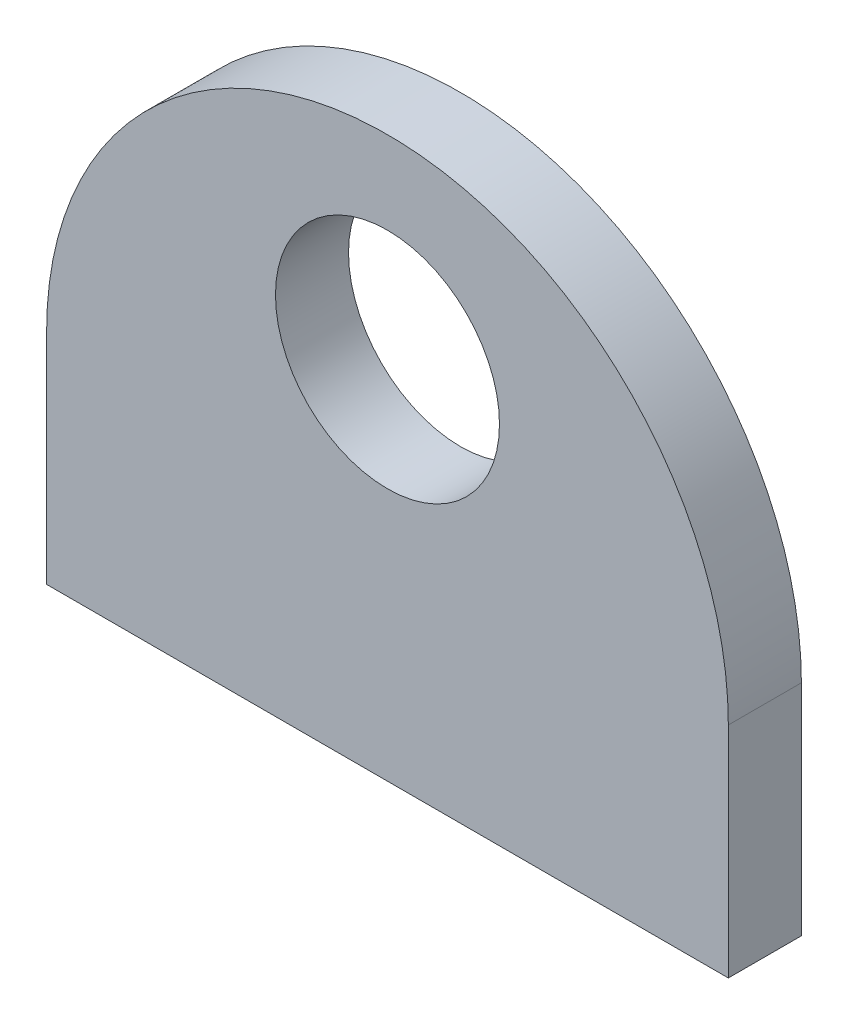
from build123d import *

# Parameters (mm, degrees)
ESQUISSE1_R          = 4.6
BASE_EXTRUSION_DEPTH = 3


with BuildPart() as part:
    # Esquisse1 → Base-Extrusion (new body)
    with BuildSketch(Plane.XY):
        with BuildLine():
            Line((14, -6), (14, -15))
            Line((14, -15), (-14, -15))
            Line((-14, -15), (-14, -6))
            ThreePointArc((-14, -6), (0, 8), (14, -6))
        make_face()
        Circle(ESQUISSE1_R, mode=Mode.SUBTRACT)
    extrude(amount=BASE_EXTRUSION_DEPTH)


solid = part.part
